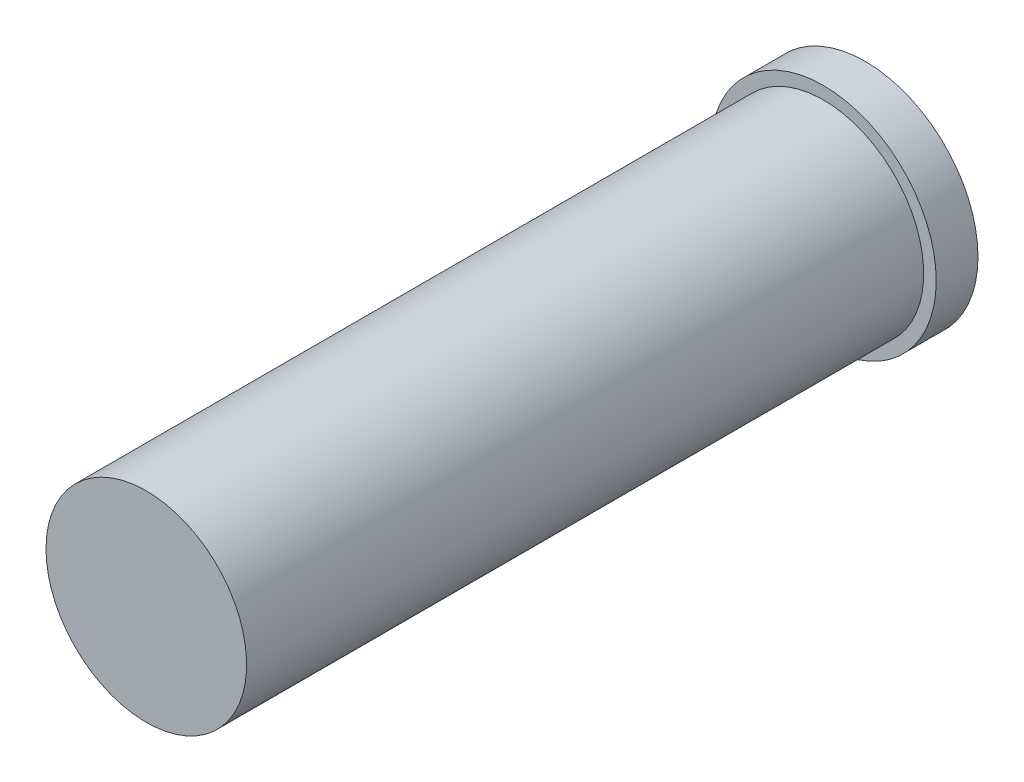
ISO-10303-21;
HEADER;
FILE_DESCRIPTION(('STEP AP214'),'2;1');
FILE_NAME('part.step','',(''),(''),'','','');
FILE_SCHEMA(('AUTOMOTIVE_DESIGN { 1 0 10303 214 1 1 1 1 }'));
ENDSEC;
DATA;
#1=APPLICATION_CONTEXT('core data for automotive mechanical design processes');
#2=APPLICATION_PROTOCOL_DEFINITION('international standard','automotive_design',2000,#1);
#3=PRODUCT_CONTEXT('',#1,'mechanical');
#4=PRODUCT('Part','Part','',(#3));
#5=PRODUCT_RELATED_PRODUCT_CATEGORY('part','',(#4));
#6=PRODUCT_DEFINITION_FORMATION('','',#4);
#7=PRODUCT_DEFINITION_CONTEXT('part definition',#1,'design');
#8=PRODUCT_DEFINITION('design','',#6,#7);
#9=PRODUCT_DEFINITION_SHAPE('','',#8);
#10=(LENGTH_UNIT() NAMED_UNIT(*) SI_UNIT(.MILLI.,.METRE.));
#11=(NAMED_UNIT(*) PLANE_ANGLE_UNIT() SI_UNIT($,.RADIAN.));
#12=(NAMED_UNIT(*) SI_UNIT($,.STERADIAN.) SOLID_ANGLE_UNIT());
#13=UNCERTAINTY_MEASURE_WITH_UNIT(LENGTH_MEASURE(1.E-05),#10,'distance_accuracy_value','');
#14=(GEOMETRIC_REPRESENTATION_CONTEXT(3) GLOBAL_UNCERTAINTY_ASSIGNED_CONTEXT((#13)) GLOBAL_UNIT_ASSIGNED_CONTEXT((#10,
#11,#12)) REPRESENTATION_CONTEXT('',''));
#15=CARTESIAN_POINT('',(0.,0.,0.));
#16=DIRECTION('',(0.,0.,1.));
#17=DIRECTION('',(1.,0.,0.));
#18=AXIS2_PLACEMENT_3D('',#15,#16,#17);
#19=CARTESIAN_POINT('',(0.,0.,8.6));
#20=DIRECTION('',(0.,0.,-1.));
#21=DIRECTION('',(-1.,0.,0.));
#22=AXIS2_PLACEMENT_3D('',#19,#20,#21);
#23=CYLINDRICAL_SURFACE('',#22,1.2);
#24=CARTESIAN_POINT('',(0.,0.,8.6));
#25=DIRECTION('',(0.,0.,1.));
#26=DIRECTION('',(1.,0.,0.));
#27=AXIS2_PLACEMENT_3D('',#24,#25,#26);
#28=CIRCLE('',#27,1.2);
#29=CARTESIAN_POINT('',(-1.2,0.,8.6));
#30=VERTEX_POINT('',#29);
#31=EDGE_CURVE('E31',#30,#30,#28,.T.);
#32=CARTESIAN_POINT('',(0.,0.,0.5));
#33=DIRECTION('',(0.,0.,-1.));
#34=DIRECTION('',(-1.,0.,0.));
#35=AXIS2_PLACEMENT_3D('',#32,#33,#34);
#36=CIRCLE('',#35,1.2);
#37=CARTESIAN_POINT('',(-1.2,0.,0.500000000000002));
#38=VERTEX_POINT('',#37);
#39=EDGE_CURVE('E10',#38,#38,#36,.T.);
#40=CARTESIAN_POINT('',(-1.2,0.,8.6));
#41=CARTESIAN_POINT('',(-1.2,0.,8.515625));
#42=CARTESIAN_POINT('',(-1.2,0.,8.43125));
#43=CARTESIAN_POINT('',(-1.2,0.,8.2625));
#44=CARTESIAN_POINT('',(-1.2,0.,8.178125));
#45=CARTESIAN_POINT('',(-1.2,0.,8.009375));
#46=CARTESIAN_POINT('',(-1.2,0.,7.925));
#47=CARTESIAN_POINT('',(-1.2,0.,7.75625));
#48=CARTESIAN_POINT('',(-1.2,0.,7.671875));
#49=CARTESIAN_POINT('',(-1.2,0.,7.503125));
#50=CARTESIAN_POINT('',(-1.2,0.,7.41875));
#51=CARTESIAN_POINT('',(-1.2,0.,7.25));
#52=CARTESIAN_POINT('',(-1.2,0.,7.165625));
#53=CARTESIAN_POINT('',(-1.2,0.,6.996875));
#54=CARTESIAN_POINT('',(-1.2,0.,6.9125));
#55=CARTESIAN_POINT('',(-1.2,0.,6.74375));
#56=CARTESIAN_POINT('',(-1.2,0.,6.659375));
#57=CARTESIAN_POINT('',(-1.2,0.,6.490625));
#58=CARTESIAN_POINT('',(-1.2,0.,6.40625));
#59=CARTESIAN_POINT('',(-1.2,0.,6.2375));
#60=CARTESIAN_POINT('',(-1.2,0.,6.153125));
#61=CARTESIAN_POINT('',(-1.2,0.,5.984375));
#62=CARTESIAN_POINT('',(-1.2,0.,5.9));
#63=CARTESIAN_POINT('',(-1.2,0.,5.73125));
#64=CARTESIAN_POINT('',(-1.2,0.,5.646875));
#65=CARTESIAN_POINT('',(-1.2,0.,5.478125));
#66=CARTESIAN_POINT('',(-1.2,0.,5.39375));
#67=CARTESIAN_POINT('',(-1.2,0.,5.225));
#68=CARTESIAN_POINT('',(-1.2,0.,5.140625));
#69=CARTESIAN_POINT('',(-1.2,0.,4.971875));
#70=CARTESIAN_POINT('',(-1.2,0.,4.8875));
#71=CARTESIAN_POINT('',(-1.2,0.,4.71875));
#72=CARTESIAN_POINT('',(-1.2,0.,4.634375));
#73=CARTESIAN_POINT('',(-1.2,0.,4.465625));
#74=CARTESIAN_POINT('',(-1.2,0.,4.38125));
#75=CARTESIAN_POINT('',(-1.2,0.,4.2125));
#76=CARTESIAN_POINT('',(-1.2,0.,4.128125));
#77=CARTESIAN_POINT('',(-1.2,0.,3.959375));
#78=CARTESIAN_POINT('',(-1.2,0.,3.875));
#79=CARTESIAN_POINT('',(-1.2,0.,3.70625));
#80=CARTESIAN_POINT('',(-1.2,0.,3.621875));
#81=CARTESIAN_POINT('',(-1.2,0.,3.453125));
#82=CARTESIAN_POINT('',(-1.2,0.,3.36875));
#83=CARTESIAN_POINT('',(-1.2,0.,3.2));
#84=CARTESIAN_POINT('',(-1.2,0.,3.115625));
#85=CARTESIAN_POINT('',(-1.2,0.,2.946875));
#86=CARTESIAN_POINT('',(-1.2,0.,2.8625));
#87=CARTESIAN_POINT('',(-1.2,0.,2.69375));
#88=CARTESIAN_POINT('',(-1.2,0.,2.609375));
#89=CARTESIAN_POINT('',(-1.2,0.,2.440625));
#90=CARTESIAN_POINT('',(-1.2,0.,2.35625));
#91=CARTESIAN_POINT('',(-1.2,0.,2.1875));
#92=CARTESIAN_POINT('',(-1.2,0.,2.103125));
#93=CARTESIAN_POINT('',(-1.2,0.,1.934375));
#94=CARTESIAN_POINT('',(-1.2,0.,1.85));
#95=CARTESIAN_POINT('',(-1.2,0.,1.68125));
#96=CARTESIAN_POINT('',(-1.2,0.,1.596875));
#97=CARTESIAN_POINT('',(-1.2,0.,1.428125));
#98=CARTESIAN_POINT('',(-1.2,0.,1.34375));
#99=CARTESIAN_POINT('',(-1.2,0.,1.175));
#100=CARTESIAN_POINT('',(-1.2,0.,1.090625));
#101=CARTESIAN_POINT('',(-1.2,0.,0.921875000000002));
#102=CARTESIAN_POINT('',(-1.2,0.,0.837500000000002));
#103=CARTESIAN_POINT('',(-1.2,0.,0.668750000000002));
#104=CARTESIAN_POINT('',(-1.2,0.,0.584375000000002));
#105=CARTESIAN_POINT('',(-1.2,0.,0.500000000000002));
#106=B_SPLINE_CURVE_WITH_KNOTS('',3,(#40,#41,#42,#43,#44,#45,#46,#47,#48,#49,#50,#51,#52,#53,
#54,#55,#56,#57,#58,#59,#60,#61,#62,#63,#64,#65,#66,#67,#68,#69,#70,#71,#72,#73,#74,#75,#76,#77,
#78,#79,#80,#81,#82,#83,#84,#85,#86,#87,#88,#89,#90,#91,#92,#93,#94,#95,#96,#97,#98,#99,#100,
#101,#102,#103,#104,#105),.UNSPECIFIED.,.F.,.F.,(4,2,2,2,2,2,2,2,2,2,2,2,2,2,2,2,2,2,2,2,2,2,2,
2,2,2,2,2,2,2,2,2,4),(0.,0.253124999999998,0.506249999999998,0.759375,1.0125,1.265625,1.51875,
1.771875,2.025,2.278125,2.53125,2.784375,3.0375,3.290625,3.54375,3.796875,4.05,4.303125,4.55625,
4.809375,5.0625,5.315625,5.56875,5.821875,6.075,6.328125,6.58125,6.834375,7.0875,7.340625,
7.59375,7.846875,8.1),.UNSPECIFIED.);
#107=EDGE_CURVE('BSEAM25',#30,#38,#106,.T.);
#108=ORIENTED_EDGE('',*,*,#31,.F.);
#109=ORIENTED_EDGE('',*,*,#39,.F.);
#110=ORIENTED_EDGE('',*,*,#107,.T.);
#111=ORIENTED_EDGE('',*,*,#107,.F.);
#112=EDGE_LOOP('',(#108,#110,#109,#111));
#113=FACE_BOUND('',#112,.T.);
#114=ADVANCED_FACE('F25',(#113),#23,.T.);
#115=CARTESIAN_POINT('',(0.,0.,8.6));
#116=DIRECTION('',(0.,0.,1.));
#117=DIRECTION('',(1.,0.,0.));
#118=AXIS2_PLACEMENT_3D('',#115,#116,#117);
#119=PLANE('',#118);
#120=ORIENTED_EDGE('',*,*,#31,.T.);
#121=EDGE_LOOP('',(#120));
#122=FACE_BOUND('',#121,.T.);
#123=ADVANCED_FACE('F57',(#122),#119,.T.);
#124=CARTESIAN_POINT('',(0.,0.,0.5));
#125=DIRECTION('',(0.,0.,-1.));
#126=DIRECTION('',(-1.,0.,0.));
#127=AXIS2_PLACEMENT_3D('',#124,#125,#126);
#128=PLANE('',#127);
#129=CARTESIAN_POINT('',(0.,0.,0.5));
#130=DIRECTION('',(0.,0.,-1.));
#131=DIRECTION('',(-1.,0.,0.));
#132=AXIS2_PLACEMENT_3D('',#129,#130,#131);
#133=CIRCLE('',#132,1.35);
#134=CARTESIAN_POINT('',(-1.35,0.,0.5));
#135=VERTEX_POINT('',#134);
#136=EDGE_CURVE('E35',#135,#135,#133,.T.);
#137=ORIENTED_EDGE('',*,*,#136,.F.);
#138=EDGE_LOOP('',(#137));
#139=FACE_BOUND('',#138,.T.);
#140=ORIENTED_EDGE('',*,*,#39,.T.);
#141=EDGE_LOOP('',(#140));
#142=FACE_BOUND('',#141,.T.);
#143=ADVANCED_FACE('F49',(#139,#142),#128,.F.);
#144=CARTESIAN_POINT('',(0.,0.,0.5));
#145=DIRECTION('',(0.,0.,-1.));
#146=DIRECTION('',(-1.,0.,0.));
#147=AXIS2_PLACEMENT_3D('',#144,#145,#146);
#148=CYLINDRICAL_SURFACE('',#147,1.35);
#149=ORIENTED_EDGE('',*,*,#136,.T.);
#150=EDGE_LOOP('',(#149));
#151=FACE_BOUND('',#150,.T.);
#152=CARTESIAN_POINT('',(0.,0.,0.));
#153=DIRECTION('',(0.,0.,-1.));
#154=DIRECTION('',(-1.,0.,0.));
#155=AXIS2_PLACEMENT_3D('',#152,#153,#154);
#156=CIRCLE('',#155,1.35);
#157=CARTESIAN_POINT('',(-1.35,0.,0.));
#158=VERTEX_POINT('',#157);
#159=EDGE_CURVE('E39',#158,#158,#156,.T.);
#160=ORIENTED_EDGE('',*,*,#159,.F.);
#161=EDGE_LOOP('',(#160));
#162=FACE_BOUND('',#161,.T.);
#163=ADVANCED_FACE('F47',(#151,#162),#148,.T.);
#164=CARTESIAN_POINT('',(0.,0.,0.));
#165=DIRECTION('',(0.,0.,1.));
#166=DIRECTION('',(1.,0.,0.));
#167=AXIS2_PLACEMENT_3D('',#164,#165,#166);
#168=PLANE('',#167);
#169=ORIENTED_EDGE('',*,*,#159,.T.);
#170=EDGE_LOOP('',(#169));
#171=FACE_BOUND('',#170,.T.);
#172=ADVANCED_FACE('F45',(#171),#168,.F.);
#173=CLOSED_SHELL('',(#114,#123,#143,#163,#172));
#174=MANIFOLD_SOLID_BREP('B2',#173);
#175=ADVANCED_BREP_SHAPE_REPRESENTATION('',(#18,#174),#14);
#176=SHAPE_DEFINITION_REPRESENTATION(#9,#175);
ENDSEC;
END-ISO-10303-21;
